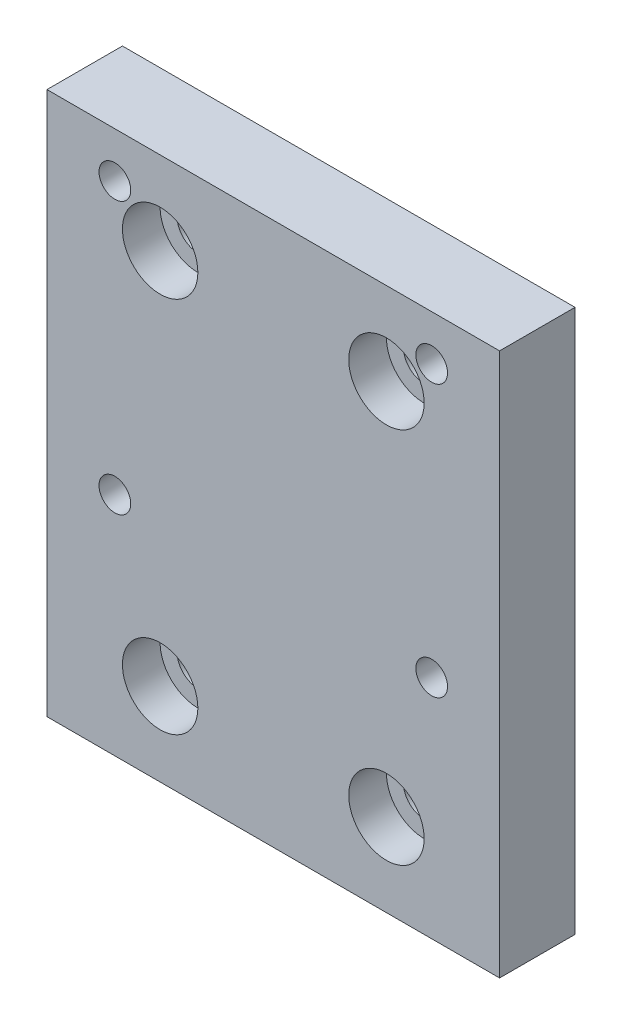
ISO-10303-21;
HEADER;
FILE_DESCRIPTION(('STEP AP214'),'2;1');
FILE_NAME('part.step','',(''),(''),'','','');
FILE_SCHEMA(('AUTOMOTIVE_DESIGN { 1 0 10303 214 1 1 1 1 }'));
ENDSEC;
DATA;
#1=APPLICATION_CONTEXT('core data for automotive mechanical design processes');
#2=APPLICATION_PROTOCOL_DEFINITION('international standard','automotive_design',2000,#1);
#3=PRODUCT_CONTEXT('',#1,'mechanical');
#4=PRODUCT('Part','Part','',(#3));
#5=PRODUCT_RELATED_PRODUCT_CATEGORY('part','',(#4));
#6=PRODUCT_DEFINITION_FORMATION('','',#4);
#7=PRODUCT_DEFINITION_CONTEXT('part definition',#1,'design');
#8=PRODUCT_DEFINITION('design','',#6,#7);
#9=PRODUCT_DEFINITION_SHAPE('','',#8);
#10=(LENGTH_UNIT() NAMED_UNIT(*) SI_UNIT(.MILLI.,.METRE.));
#11=(NAMED_UNIT(*) PLANE_ANGLE_UNIT() SI_UNIT($,.RADIAN.));
#12=(NAMED_UNIT(*) SI_UNIT($,.STERADIAN.) SOLID_ANGLE_UNIT());
#13=UNCERTAINTY_MEASURE_WITH_UNIT(LENGTH_MEASURE(1.E-05),#10,'distance_accuracy_value','');
#14=(GEOMETRIC_REPRESENTATION_CONTEXT(3) GLOBAL_UNCERTAINTY_ASSIGNED_CONTEXT((#13)) GLOBAL_UNIT_ASSIGNED_CONTEXT((#10,
#11,#12)) REPRESENTATION_CONTEXT('',''));
#15=CARTESIAN_POINT('',(0.,0.,0.));
#16=DIRECTION('',(0.,0.,1.));
#17=DIRECTION('',(1.,0.,0.));
#18=AXIS2_PLACEMENT_3D('',#15,#16,#17);
#19=CARTESIAN_POINT('',(15.,-25.,5.));
#20=DIRECTION('',(0.,0.,1.));
#21=DIRECTION('',(1.,0.,0.));
#22=AXIS2_PLACEMENT_3D('',#19,#20,#21);
#23=CYLINDRICAL_SURFACE('',#22,5.);
#24=CARTESIAN_POINT('',(15.,-25.,10.));
#25=DIRECTION('',(0.,0.,1.));
#26=DIRECTION('',(1.,0.,0.));
#27=AXIS2_PLACEMENT_3D('',#24,#25,#26);
#28=CIRCLE('',#27,5.);
#29=CARTESIAN_POINT('',(20.,-25.,10.));
#30=VERTEX_POINT('',#29);
#31=EDGE_CURVE('E139',#30,#30,#28,.F.);
#32=ORIENTED_EDGE('',*,*,#31,.F.);
#33=EDGE_LOOP('',(#32));
#34=FACE_BOUND('',#33,.T.);
#35=CARTESIAN_POINT('',(15.,-25.,5.));
#36=DIRECTION('',(0.,0.,1.));
#37=DIRECTION('',(1.,0.,0.));
#38=AXIS2_PLACEMENT_3D('',#35,#36,#37);
#39=CIRCLE('',#38,5.);
#40=CARTESIAN_POINT('',(20.,-25.,5.));
#41=VERTEX_POINT('',#40);
#42=EDGE_CURVE('E20',#41,#41,#39,.T.);
#43=ORIENTED_EDGE('',*,*,#42,.F.);
#44=EDGE_LOOP('',(#43));
#45=FACE_BOUND('',#44,.T.);
#46=ADVANCED_FACE('F17',(#34,#45),#23,.F.);
#47=CARTESIAN_POINT('',(15.,25.,5.));
#48=DIRECTION('',(0.,0.,1.));
#49=DIRECTION('',(1.,0.,0.));
#50=AXIS2_PLACEMENT_3D('',#47,#48,#49);
#51=CYLINDRICAL_SURFACE('',#50,5.);
#52=CARTESIAN_POINT('',(15.,25.,10.));
#53=DIRECTION('',(0.,0.,1.));
#54=DIRECTION('',(1.,0.,0.));
#55=AXIS2_PLACEMENT_3D('',#52,#53,#54);
#56=CIRCLE('',#55,5.);
#57=CARTESIAN_POINT('',(20.,25.,10.));
#58=VERTEX_POINT('',#57);
#59=EDGE_CURVE('E136',#58,#58,#56,.F.);
#60=ORIENTED_EDGE('',*,*,#59,.F.);
#61=EDGE_LOOP('',(#60));
#62=FACE_BOUND('',#61,.T.);
#63=CARTESIAN_POINT('',(15.,25.,5.));
#64=DIRECTION('',(0.,0.,1.));
#65=DIRECTION('',(1.,0.,0.));
#66=AXIS2_PLACEMENT_3D('',#63,#64,#65);
#67=CIRCLE('',#66,5.);
#68=CARTESIAN_POINT('',(20.,25.,5.));
#69=VERTEX_POINT('',#68);
#70=EDGE_CURVE('E147',#69,#69,#67,.T.);
#71=ORIENTED_EDGE('',*,*,#70,.F.);
#72=EDGE_LOOP('',(#71));
#73=FACE_BOUND('',#72,.T.);
#74=ADVANCED_FACE('F157',(#62,#73),#51,.F.);
#75=CARTESIAN_POINT('',(-15.,-25.,5.));
#76=DIRECTION('',(0.,0.,1.));
#77=DIRECTION('',(1.,0.,0.));
#78=AXIS2_PLACEMENT_3D('',#75,#76,#77);
#79=CYLINDRICAL_SURFACE('',#78,5.);
#80=CARTESIAN_POINT('',(-15.,-25.,10.));
#81=DIRECTION('',(0.,0.,1.));
#82=DIRECTION('',(1.,0.,0.));
#83=AXIS2_PLACEMENT_3D('',#80,#81,#82);
#84=CIRCLE('',#83,5.);
#85=CARTESIAN_POINT('',(-9.99999999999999,-25.,10.));
#86=VERTEX_POINT('',#85);
#87=EDGE_CURVE('E133',#86,#86,#84,.F.);
#88=ORIENTED_EDGE('',*,*,#87,.F.);
#89=EDGE_LOOP('',(#88));
#90=FACE_BOUND('',#89,.T.);
#91=CARTESIAN_POINT('',(-15.,-25.,5.));
#92=DIRECTION('',(0.,0.,1.));
#93=DIRECTION('',(1.,0.,0.));
#94=AXIS2_PLACEMENT_3D('',#91,#92,#93);
#95=CIRCLE('',#94,5.);
#96=CARTESIAN_POINT('',(-9.99999999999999,-25.,5.));
#97=VERTEX_POINT('',#96);
#98=EDGE_CURVE('E145',#97,#97,#95,.T.);
#99=ORIENTED_EDGE('',*,*,#98,.F.);
#100=EDGE_LOOP('',(#99));
#101=FACE_BOUND('',#100,.T.);
#102=ADVANCED_FACE('F163',(#90,#101),#79,.F.);
#103=CARTESIAN_POINT('',(-15.,25.,5.));
#104=DIRECTION('',(0.,0.,1.));
#105=DIRECTION('',(1.,0.,0.));
#106=AXIS2_PLACEMENT_3D('',#103,#104,#105);
#107=CYLINDRICAL_SURFACE('',#106,5.);
#108=CARTESIAN_POINT('',(-15.,25.,10.));
#109=DIRECTION('',(0.,0.,1.));
#110=DIRECTION('',(1.,0.,0.));
#111=AXIS2_PLACEMENT_3D('',#108,#109,#110);
#112=CIRCLE('',#111,5.);
#113=CARTESIAN_POINT('',(-10.,25.,10.));
#114=VERTEX_POINT('',#113);
#115=EDGE_CURVE('E130',#114,#114,#112,.F.);
#116=ORIENTED_EDGE('',*,*,#115,.F.);
#117=EDGE_LOOP('',(#116));
#118=FACE_BOUND('',#117,.T.);
#119=CARTESIAN_POINT('',(-15.,25.,5.));
#120=DIRECTION('',(0.,0.,1.));
#121=DIRECTION('',(1.,0.,0.));
#122=AXIS2_PLACEMENT_3D('',#119,#120,#121);
#123=CIRCLE('',#122,5.);
#124=CARTESIAN_POINT('',(-10.,25.,5.));
#125=VERTEX_POINT('',#124);
#126=EDGE_CURVE('E142',#125,#125,#123,.T.);
#127=ORIENTED_EDGE('',*,*,#126,.F.);
#128=EDGE_LOOP('',(#127));
#129=FACE_BOUND('',#128,.T.);
#130=ADVANCED_FACE('F234',(#118,#129),#107,.F.);
#131=CARTESIAN_POINT('',(15.,-25.,5.));
#132=DIRECTION('',(0.,0.,1.));
#133=DIRECTION('',(1.,0.,0.));
#134=AXIS2_PLACEMENT_3D('',#131,#132,#133);
#135=PLANE('',#134);
#136=CARTESIAN_POINT('',(15.,-25.,5.));
#137=DIRECTION('',(0.,0.,1.));
#138=DIRECTION('',(1.,0.,0.));
#139=AXIS2_PLACEMENT_3D('',#136,#137,#138);
#140=CIRCLE('',#139,2.75);
#141=CARTESIAN_POINT('',(17.75,-25.,5.));
#142=VERTEX_POINT('',#141);
#143=EDGE_CURVE('E115',#142,#142,#140,.F.);
#144=ORIENTED_EDGE('',*,*,#143,.T.);
#145=EDGE_LOOP('',(#144));
#146=FACE_BOUND('',#145,.T.);
#147=ORIENTED_EDGE('',*,*,#42,.T.);
#148=EDGE_LOOP('',(#147));
#149=FACE_BOUND('',#148,.T.);
#150=ADVANCED_FACE('F154',(#146,#149),#135,.T.);
#151=CARTESIAN_POINT('',(15.,25.,5.));
#152=DIRECTION('',(0.,0.,1.));
#153=DIRECTION('',(1.,0.,0.));
#154=AXIS2_PLACEMENT_3D('',#151,#152,#153);
#155=PLANE('',#154);
#156=CARTESIAN_POINT('',(15.,25.,5.));
#157=DIRECTION('',(0.,0.,1.));
#158=DIRECTION('',(1.,0.,0.));
#159=AXIS2_PLACEMENT_3D('',#156,#157,#158);
#160=CIRCLE('',#159,2.75);
#161=CARTESIAN_POINT('',(17.75,25.,5.));
#162=VERTEX_POINT('',#161);
#163=EDGE_CURVE('E112',#162,#162,#160,.F.);
#164=ORIENTED_EDGE('',*,*,#163,.T.);
#165=EDGE_LOOP('',(#164));
#166=FACE_BOUND('',#165,.T.);
#167=ORIENTED_EDGE('',*,*,#70,.T.);
#168=EDGE_LOOP('',(#167));
#169=FACE_BOUND('',#168,.T.);
#170=ADVANCED_FACE('F227',(#166,#169),#155,.T.);
#171=CARTESIAN_POINT('',(-15.,-25.,5.));
#172=DIRECTION('',(0.,0.,1.));
#173=DIRECTION('',(1.,0.,0.));
#174=AXIS2_PLACEMENT_3D('',#171,#172,#173);
#175=PLANE('',#174);
#176=CARTESIAN_POINT('',(-15.,-25.,5.));
#177=DIRECTION('',(0.,0.,1.));
#178=DIRECTION('',(1.,0.,0.));
#179=AXIS2_PLACEMENT_3D('',#176,#177,#178);
#180=CIRCLE('',#179,2.75);
#181=CARTESIAN_POINT('',(-12.25,-25.,5.));
#182=VERTEX_POINT('',#181);
#183=EDGE_CURVE('E109',#182,#182,#180,.F.);
#184=ORIENTED_EDGE('',*,*,#183,.T.);
#185=EDGE_LOOP('',(#184));
#186=FACE_BOUND('',#185,.T.);
#187=ORIENTED_EDGE('',*,*,#98,.T.);
#188=EDGE_LOOP('',(#187));
#189=FACE_BOUND('',#188,.T.);
#190=ADVANCED_FACE('F223',(#186,#189),#175,.T.);
#191=CARTESIAN_POINT('',(-15.,25.,5.));
#192=DIRECTION('',(0.,0.,1.));
#193=DIRECTION('',(1.,0.,0.));
#194=AXIS2_PLACEMENT_3D('',#191,#192,#193);
#195=PLANE('',#194);
#196=CARTESIAN_POINT('',(-15.,25.,5.));
#197=DIRECTION('',(0.,0.,1.));
#198=DIRECTION('',(1.,0.,0.));
#199=AXIS2_PLACEMENT_3D('',#196,#197,#198);
#200=CIRCLE('',#199,2.75);
#201=CARTESIAN_POINT('',(-12.25,25.,5.));
#202=VERTEX_POINT('',#201);
#203=EDGE_CURVE('E67',#202,#202,#200,.F.);
#204=ORIENTED_EDGE('',*,*,#203,.T.);
#205=EDGE_LOOP('',(#204));
#206=FACE_BOUND('',#205,.T.);
#207=ORIENTED_EDGE('',*,*,#126,.T.);
#208=EDGE_LOOP('',(#207));
#209=FACE_BOUND('',#208,.T.);
#210=ADVANCED_FACE('F220',(#206,#209),#195,.T.);
#211=CARTESIAN_POINT('',(0.,0.,10.));
#212=DIRECTION('',(0.,0.,1.));
#213=DIRECTION('',(1.,0.,0.));
#214=AXIS2_PLACEMENT_3D('',#211,#212,#213);
#215=PLANE('',#214);
#216=DIRECTION('',(0.,1.,0.));
#217=VECTOR('',#216,1.);
#218=CARTESIAN_POINT('',(-30.,36.,10.));
#219=LINE('',#218,#217);
#220=CARTESIAN_POINT('',(-30.,36.,10.));
#221=VERTEX_POINT('',#220);
#222=CARTESIAN_POINT('',(-30.,-36.,10.));
#223=VERTEX_POINT('',#222);
#224=EDGE_CURVE('E55',#221,#223,#219,.F.);
#225=ORIENTED_EDGE('',*,*,#224,.T.);
#226=DIRECTION('',(1.,0.,0.));
#227=VECTOR('',#226,1.);
#228=CARTESIAN_POINT('',(-30.,-36.,10.));
#229=LINE('',#228,#227);
#230=CARTESIAN_POINT('',(30.,-36.,10.));
#231=VERTEX_POINT('',#230);
#232=EDGE_CURVE('E460',#223,#231,#229,.T.);
#233=ORIENTED_EDGE('',*,*,#232,.T.);
#234=DIRECTION('',(0.,-1.,0.));
#235=VECTOR('',#234,1.);
#236=CARTESIAN_POINT('',(30.,36.,10.));
#237=LINE('',#236,#235);
#238=CARTESIAN_POINT('',(30.,36.,10.));
#239=VERTEX_POINT('',#238);
#240=EDGE_CURVE('E61',#231,#239,#237,.F.);
#241=ORIENTED_EDGE('',*,*,#240,.T.);
#242=DIRECTION('',(1.,0.,0.));
#243=VECTOR('',#242,1.);
#244=CARTESIAN_POINT('',(-30.,36.,10.));
#245=LINE('',#244,#243);
#246=EDGE_CURVE('E58',#239,#221,#245,.F.);
#247=ORIENTED_EDGE('',*,*,#246,.T.);
#248=EDGE_LOOP('',(#225,#233,#241,#247));
#249=FACE_BOUND('',#248,.T.);
#250=ORIENTED_EDGE('',*,*,#115,.T.);
#251=EDGE_LOOP('',(#250));
#252=FACE_BOUND('',#251,.T.);
#253=ORIENTED_EDGE('',*,*,#87,.T.);
#254=EDGE_LOOP('',(#253));
#255=FACE_BOUND('',#254,.T.);
#256=ORIENTED_EDGE('',*,*,#59,.T.);
#257=EDGE_LOOP('',(#256));
#258=FACE_BOUND('',#257,.T.);
#259=ORIENTED_EDGE('',*,*,#31,.T.);
#260=EDGE_LOOP('',(#259));
#261=FACE_BOUND('',#260,.T.);
#262=CARTESIAN_POINT('',(-21.,-5.99999999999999,10.));
#263=DIRECTION('',(0.,0.,1.));
#264=DIRECTION('',(1.,0.,0.));
#265=AXIS2_PLACEMENT_3D('',#262,#263,#264);
#266=CIRCLE('',#265,2.1);
#267=CARTESIAN_POINT('',(-18.9,-5.99999999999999,10.));
#268=VERTEX_POINT('',#267);
#269=EDGE_CURVE('E118',#268,#268,#266,.F.);
#270=ORIENTED_EDGE('',*,*,#269,.T.);
#271=EDGE_LOOP('',(#270));
#272=FACE_BOUND('',#271,.T.);
#273=CARTESIAN_POINT('',(21.,-5.99999999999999,10.));
#274=DIRECTION('',(0.,0.,1.));
#275=DIRECTION('',(1.,0.,0.));
#276=AXIS2_PLACEMENT_3D('',#273,#274,#275);
#277=CIRCLE('',#276,2.1);
#278=CARTESIAN_POINT('',(23.1,-5.99999999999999,10.));
#279=VERTEX_POINT('',#278);
#280=EDGE_CURVE('E121',#279,#279,#277,.F.);
#281=ORIENTED_EDGE('',*,*,#280,.T.);
#282=EDGE_LOOP('',(#281));
#283=FACE_BOUND('',#282,.T.);
#284=CARTESIAN_POINT('',(21.,30.,10.));
#285=DIRECTION('',(0.,0.,1.));
#286=DIRECTION('',(1.,0.,0.));
#287=AXIS2_PLACEMENT_3D('',#284,#285,#286);
#288=CIRCLE('',#287,2.1);
#289=CARTESIAN_POINT('',(23.1,30.,10.));
#290=VERTEX_POINT('',#289);
#291=EDGE_CURVE('E124',#290,#290,#288,.F.);
#292=ORIENTED_EDGE('',*,*,#291,.T.);
#293=EDGE_LOOP('',(#292));
#294=FACE_BOUND('',#293,.T.);
#295=CARTESIAN_POINT('',(-21.,30.,10.));
#296=DIRECTION('',(0.,0.,1.));
#297=DIRECTION('',(1.,0.,0.));
#298=AXIS2_PLACEMENT_3D('',#295,#296,#297);
#299=CIRCLE('',#298,2.1);
#300=CARTESIAN_POINT('',(-18.9,30.,10.));
#301=VERTEX_POINT('',#300);
#302=EDGE_CURVE('E127',#301,#301,#299,.F.);
#303=ORIENTED_EDGE('',*,*,#302,.T.);
#304=EDGE_LOOP('',(#303));
#305=FACE_BOUND('',#304,.T.);
#306=ADVANCED_FACE('F59',(#249,#252,#255,#258,#261,#272,#283,#294,#305),#215,.T.);
#307=CARTESIAN_POINT('',(-21.,30.,10.));
#308=DIRECTION('',(0.,0.,1.));
#309=DIRECTION('',(1.,0.,0.));
#310=AXIS2_PLACEMENT_3D('',#307,#308,#309);
#311=CYLINDRICAL_SURFACE('',#310,2.1);
#312=CARTESIAN_POINT('',(-21.,30.,0.));
#313=DIRECTION('',(0.,0.,1.));
#314=DIRECTION('',(1.,0.,0.));
#315=AXIS2_PLACEMENT_3D('',#312,#313,#314);
#316=CIRCLE('',#315,2.1);
#317=CARTESIAN_POINT('',(-18.9,30.,0.));
#318=VERTEX_POINT('',#317);
#319=EDGE_CURVE('E103',#318,#318,#316,.F.);
#320=ORIENTED_EDGE('',*,*,#319,.T.);
#321=EDGE_LOOP('',(#320));
#322=FACE_BOUND('',#321,.T.);
#323=ORIENTED_EDGE('',*,*,#302,.F.);
#324=EDGE_LOOP('',(#323));
#325=FACE_BOUND('',#324,.T.);
#326=ADVANCED_FACE('F213',(#322,#325),#311,.F.);
#327=CARTESIAN_POINT('',(21.,30.,10.));
#328=DIRECTION('',(0.,0.,1.));
#329=DIRECTION('',(1.,0.,0.));
#330=AXIS2_PLACEMENT_3D('',#327,#328,#329);
#331=CYLINDRICAL_SURFACE('',#330,2.1);
#332=CARTESIAN_POINT('',(21.,30.,0.));
#333=DIRECTION('',(0.,0.,1.));
#334=DIRECTION('',(1.,0.,0.));
#335=AXIS2_PLACEMENT_3D('',#332,#333,#334);
#336=CIRCLE('',#335,2.1);
#337=CARTESIAN_POINT('',(23.1,30.,0.));
#338=VERTEX_POINT('',#337);
#339=EDGE_CURVE('E100',#338,#338,#336,.F.);
#340=ORIENTED_EDGE('',*,*,#339,.T.);
#341=EDGE_LOOP('',(#340));
#342=FACE_BOUND('',#341,.T.);
#343=ORIENTED_EDGE('',*,*,#291,.F.);
#344=EDGE_LOOP('',(#343));
#345=FACE_BOUND('',#344,.T.);
#346=ADVANCED_FACE('F209',(#342,#345),#331,.F.);
#347=CARTESIAN_POINT('',(21.,-5.99999999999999,10.));
#348=DIRECTION('',(0.,0.,1.));
#349=DIRECTION('',(1.,0.,0.));
#350=AXIS2_PLACEMENT_3D('',#347,#348,#349);
#351=CYLINDRICAL_SURFACE('',#350,2.1);
#352=CARTESIAN_POINT('',(21.,-5.99999999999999,0.));
#353=DIRECTION('',(0.,0.,1.));
#354=DIRECTION('',(1.,0.,0.));
#355=AXIS2_PLACEMENT_3D('',#352,#353,#354);
#356=CIRCLE('',#355,2.1);
#357=CARTESIAN_POINT('',(23.1,-5.99999999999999,0.));
#358=VERTEX_POINT('',#357);
#359=EDGE_CURVE('E97',#358,#358,#356,.F.);
#360=ORIENTED_EDGE('',*,*,#359,.T.);
#361=EDGE_LOOP('',(#360));
#362=FACE_BOUND('',#361,.T.);
#363=ORIENTED_EDGE('',*,*,#280,.F.);
#364=EDGE_LOOP('',(#363));
#365=FACE_BOUND('',#364,.T.);
#366=ADVANCED_FACE('F205',(#362,#365),#351,.F.);
#367=CARTESIAN_POINT('',(-21.,-5.99999999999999,10.));
#368=DIRECTION('',(0.,0.,1.));
#369=DIRECTION('',(1.,0.,0.));
#370=AXIS2_PLACEMENT_3D('',#367,#368,#369);
#371=CYLINDRICAL_SURFACE('',#370,2.1);
#372=CARTESIAN_POINT('',(-21.,-5.99999999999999,0.));
#373=DIRECTION('',(0.,0.,1.));
#374=DIRECTION('',(1.,0.,0.));
#375=AXIS2_PLACEMENT_3D('',#372,#373,#374);
#376=CIRCLE('',#375,2.1);
#377=CARTESIAN_POINT('',(-18.9,-5.99999999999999,0.));
#378=VERTEX_POINT('',#377);
#379=EDGE_CURVE('E94',#378,#378,#376,.F.);
#380=ORIENTED_EDGE('',*,*,#379,.T.);
#381=EDGE_LOOP('',(#380));
#382=FACE_BOUND('',#381,.T.);
#383=ORIENTED_EDGE('',*,*,#269,.F.);
#384=EDGE_LOOP('',(#383));
#385=FACE_BOUND('',#384,.T.);
#386=ADVANCED_FACE('F201',(#382,#385),#371,.F.);
#387=CARTESIAN_POINT('',(15.,-25.,0.));
#388=DIRECTION('',(0.,0.,1.));
#389=DIRECTION('',(1.,0.,0.));
#390=AXIS2_PLACEMENT_3D('',#387,#388,#389);
#391=CYLINDRICAL_SURFACE('',#390,2.75);
#392=CARTESIAN_POINT('',(15.,-25.,0.));
#393=DIRECTION('',(0.,0.,1.));
#394=DIRECTION('',(1.,0.,0.));
#395=AXIS2_PLACEMENT_3D('',#392,#393,#394);
#396=CIRCLE('',#395,2.75);
#397=CARTESIAN_POINT('',(17.75,-25.,0.));
#398=VERTEX_POINT('',#397);
#399=EDGE_CURVE('E91',#398,#398,#396,.F.);
#400=ORIENTED_EDGE('',*,*,#399,.T.);
#401=EDGE_LOOP('',(#400));
#402=FACE_BOUND('',#401,.T.);
#403=ORIENTED_EDGE('',*,*,#143,.F.);
#404=EDGE_LOOP('',(#403));
#405=FACE_BOUND('',#404,.T.);
#406=ADVANCED_FACE('F197',(#402,#405),#391,.F.);
#407=CARTESIAN_POINT('',(15.,25.,0.));
#408=DIRECTION('',(0.,0.,1.));
#409=DIRECTION('',(1.,0.,0.));
#410=AXIS2_PLACEMENT_3D('',#407,#408,#409);
#411=CYLINDRICAL_SURFACE('',#410,2.75);
#412=CARTESIAN_POINT('',(15.,25.,0.));
#413=DIRECTION('',(0.,0.,1.));
#414=DIRECTION('',(1.,0.,0.));
#415=AXIS2_PLACEMENT_3D('',#412,#413,#414);
#416=CIRCLE('',#415,2.75);
#417=CARTESIAN_POINT('',(17.75,25.,0.));
#418=VERTEX_POINT('',#417);
#419=EDGE_CURVE('E88',#418,#418,#416,.F.);
#420=ORIENTED_EDGE('',*,*,#419,.T.);
#421=EDGE_LOOP('',(#420));
#422=FACE_BOUND('',#421,.T.);
#423=ORIENTED_EDGE('',*,*,#163,.F.);
#424=EDGE_LOOP('',(#423));
#425=FACE_BOUND('',#424,.T.);
#426=ADVANCED_FACE('F193',(#422,#425),#411,.F.);
#427=CARTESIAN_POINT('',(-15.,-25.,0.));
#428=DIRECTION('',(0.,0.,1.));
#429=DIRECTION('',(1.,0.,0.));
#430=AXIS2_PLACEMENT_3D('',#427,#428,#429);
#431=CYLINDRICAL_SURFACE('',#430,2.75);
#432=CARTESIAN_POINT('',(-15.,-25.,0.));
#433=DIRECTION('',(0.,0.,1.));
#434=DIRECTION('',(1.,0.,0.));
#435=AXIS2_PLACEMENT_3D('',#432,#433,#434);
#436=CIRCLE('',#435,2.75);
#437=CARTESIAN_POINT('',(-12.25,-25.,0.));
#438=VERTEX_POINT('',#437);
#439=EDGE_CURVE('E85',#438,#438,#436,.F.);
#440=ORIENTED_EDGE('',*,*,#439,.T.);
#441=EDGE_LOOP('',(#440));
#442=FACE_BOUND('',#441,.T.);
#443=ORIENTED_EDGE('',*,*,#183,.F.);
#444=EDGE_LOOP('',(#443));
#445=FACE_BOUND('',#444,.T.);
#446=ADVANCED_FACE('F189',(#442,#445),#431,.F.);
#447=CARTESIAN_POINT('',(-15.,25.,0.));
#448=DIRECTION('',(0.,0.,1.));
#449=DIRECTION('',(1.,0.,0.));
#450=AXIS2_PLACEMENT_3D('',#447,#448,#449);
#451=CYLINDRICAL_SURFACE('',#450,2.75);
#452=CARTESIAN_POINT('',(-15.,25.,0.));
#453=DIRECTION('',(0.,0.,1.));
#454=DIRECTION('',(1.,0.,0.));
#455=AXIS2_PLACEMENT_3D('',#452,#453,#454);
#456=CIRCLE('',#455,2.75);
#457=CARTESIAN_POINT('',(-12.25,25.,0.));
#458=VERTEX_POINT('',#457);
#459=EDGE_CURVE('E82',#458,#458,#456,.F.);
#460=ORIENTED_EDGE('',*,*,#459,.T.);
#461=EDGE_LOOP('',(#460));
#462=FACE_BOUND('',#461,.T.);
#463=ORIENTED_EDGE('',*,*,#203,.F.);
#464=EDGE_LOOP('',(#463));
#465=FACE_BOUND('',#464,.T.);
#466=ADVANCED_FACE('F186',(#462,#465),#451,.F.);
#467=CARTESIAN_POINT('',(-30.,36.,10.));
#468=DIRECTION('',(0.,-1.,0.));
#469=DIRECTION('',(0.,0.,-1.));
#470=AXIS2_PLACEMENT_3D('',#467,#468,#469);
#471=PLANE('',#470);
#472=DIRECTION('',(0.,0.,1.));
#473=VECTOR('',#472,1.);
#474=CARTESIAN_POINT('',(-30.,36.,10.));
#475=LINE('',#474,#473);
#476=CARTESIAN_POINT('',(-30.,36.,0.));
#477=VERTEX_POINT('',#476);
#478=EDGE_CURVE('E66',#477,#221,#475,.T.);
#479=ORIENTED_EDGE('',*,*,#478,.T.);
#480=ORIENTED_EDGE('',*,*,#246,.F.);
#481=DIRECTION('',(0.,0.,1.));
#482=VECTOR('',#481,1.);
#483=CARTESIAN_POINT('',(30.,36.,10.));
#484=LINE('',#483,#482);
#485=CARTESIAN_POINT('',(30.,36.,0.));
#486=VERTEX_POINT('',#485);
#487=EDGE_CURVE('E106',#239,#486,#484,.F.);
#488=ORIENTED_EDGE('',*,*,#487,.T.);
#489=DIRECTION('',(1.,0.,0.));
#490=VECTOR('',#489,1.);
#491=CARTESIAN_POINT('',(0.,36.,0.));
#492=LINE('',#491,#490);
#493=EDGE_CURVE('E78',#486,#477,#492,.F.);
#494=ORIENTED_EDGE('',*,*,#493,.T.);
#495=EDGE_LOOP('',(#479,#480,#488,#494));
#496=FACE_BOUND('',#495,.T.);
#497=ADVANCED_FACE('F77',(#496),#471,.F.);
#498=CARTESIAN_POINT('',(-30.,36.,10.));
#499=DIRECTION('',(1.,0.,0.));
#500=DIRECTION('',(0.,1.,0.));
#501=AXIS2_PLACEMENT_3D('',#498,#499,#500);
#502=PLANE('',#501);
#503=DIRECTION('',(0.,0.,1.));
#504=VECTOR('',#503,1.);
#505=CARTESIAN_POINT('',(-30.,-36.,10.));
#506=LINE('',#505,#504);
#507=CARTESIAN_POINT('',(-30.,-36.,0.));
#508=VERTEX_POINT('',#507);
#509=EDGE_CURVE('E74',#508,#223,#506,.T.);
#510=ORIENTED_EDGE('',*,*,#509,.T.);
#511=ORIENTED_EDGE('',*,*,#224,.F.);
#512=ORIENTED_EDGE('',*,*,#478,.F.);
#513=DIRECTION('',(0.,1.,0.));
#514=VECTOR('',#513,1.);
#515=CARTESIAN_POINT('',(-30.,0.,0.));
#516=LINE('',#515,#514);
#517=EDGE_CURVE('E467',#477,#508,#516,.F.);
#518=ORIENTED_EDGE('',*,*,#517,.T.);
#519=EDGE_LOOP('',(#510,#511,#512,#518));
#520=FACE_BOUND('',#519,.T.);
#521=ADVANCED_FACE('F71',(#520),#502,.F.);
#522=CARTESIAN_POINT('',(-30.,-36.,10.));
#523=DIRECTION('',(0.,1.,0.));
#524=DIRECTION('',(0.,0.,1.));
#525=AXIS2_PLACEMENT_3D('',#522,#523,#524);
#526=PLANE('',#525);
#527=DIRECTION('',(0.,0.,1.));
#528=VECTOR('',#527,1.);
#529=CARTESIAN_POINT('',(30.,-36.,10.));
#530=LINE('',#529,#528);
#531=CARTESIAN_POINT('',(30.,-36.,0.));
#532=VERTEX_POINT('',#531);
#533=EDGE_CURVE('E34',#532,#231,#530,.T.);
#534=ORIENTED_EDGE('',*,*,#533,.T.);
#535=ORIENTED_EDGE('',*,*,#232,.F.);
#536=ORIENTED_EDGE('',*,*,#509,.F.);
#537=DIRECTION('',(1.,0.,0.));
#538=VECTOR('',#537,1.);
#539=CARTESIAN_POINT('',(0.,-36.,0.));
#540=LINE('',#539,#538);
#541=EDGE_CURVE('E26',#508,#532,#540,.T.);
#542=ORIENTED_EDGE('',*,*,#541,.T.);
#543=EDGE_LOOP('',(#534,#535,#536,#542));
#544=FACE_BOUND('',#543,.T.);
#545=ADVANCED_FACE('F174',(#544),#526,.F.);
#546=CARTESIAN_POINT('',(30.,36.,10.));
#547=DIRECTION('',(-1.,0.,0.));
#548=DIRECTION('',(0.,-1.,0.));
#549=AXIS2_PLACEMENT_3D('',#546,#547,#548);
#550=PLANE('',#549);
#551=ORIENTED_EDGE('',*,*,#487,.F.);
#552=ORIENTED_EDGE('',*,*,#240,.F.);
#553=ORIENTED_EDGE('',*,*,#533,.F.);
#554=DIRECTION('',(0.,1.,0.));
#555=VECTOR('',#554,1.);
#556=CARTESIAN_POINT('',(30.,0.,0.));
#557=LINE('',#556,#555);
#558=EDGE_CURVE('E11',#532,#486,#557,.T.);
#559=ORIENTED_EDGE('',*,*,#558,.T.);
#560=EDGE_LOOP('',(#551,#552,#553,#559));
#561=FACE_BOUND('',#560,.T.);
#562=ADVANCED_FACE('F168',(#561),#550,.F.);
#563=CARTESIAN_POINT('',(0.,0.,0.));
#564=DIRECTION('',(0.,0.,1.));
#565=DIRECTION('',(1.,0.,0.));
#566=AXIS2_PLACEMENT_3D('',#563,#564,#565);
#567=PLANE('',#566);
#568=ORIENTED_EDGE('',*,*,#541,.F.);
#569=ORIENTED_EDGE('',*,*,#517,.F.);
#570=ORIENTED_EDGE('',*,*,#493,.F.);
#571=ORIENTED_EDGE('',*,*,#558,.F.);
#572=EDGE_LOOP('',(#568,#569,#570,#571));
#573=FACE_BOUND('',#572,.T.);
#574=ORIENTED_EDGE('',*,*,#459,.F.);
#575=EDGE_LOOP('',(#574));
#576=FACE_BOUND('',#575,.T.);
#577=ORIENTED_EDGE('',*,*,#439,.F.);
#578=EDGE_LOOP('',(#577));
#579=FACE_BOUND('',#578,.T.);
#580=ORIENTED_EDGE('',*,*,#419,.F.);
#581=EDGE_LOOP('',(#580));
#582=FACE_BOUND('',#581,.T.);
#583=ORIENTED_EDGE('',*,*,#399,.F.);
#584=EDGE_LOOP('',(#583));
#585=FACE_BOUND('',#584,.T.);
#586=ORIENTED_EDGE('',*,*,#379,.F.);
#587=EDGE_LOOP('',(#586));
#588=FACE_BOUND('',#587,.T.);
#589=ORIENTED_EDGE('',*,*,#359,.F.);
#590=EDGE_LOOP('',(#589));
#591=FACE_BOUND('',#590,.T.);
#592=ORIENTED_EDGE('',*,*,#339,.F.);
#593=EDGE_LOOP('',(#592));
#594=FACE_BOUND('',#593,.T.);
#595=ORIENTED_EDGE('',*,*,#319,.F.);
#596=EDGE_LOOP('',(#595));
#597=FACE_BOUND('',#596,.T.);
#598=ADVANCED_FACE('F166',(#573,#576,#579,#582,#585,#588,#591,#594,#597),#567,.F.);
#599=CLOSED_SHELL('',(#46,#74,#102,#130,#150,#170,#190,#210,#306,#326,#346,#366,#386,#406,#426,
#446,#466,#497,#521,#545,#562,#598));
#600=MANIFOLD_SOLID_BREP('B1',#599);
#601=ADVANCED_BREP_SHAPE_REPRESENTATION('',(#18,#600),#14);
#602=SHAPE_DEFINITION_REPRESENTATION(#9,#601);
ENDSEC;
END-ISO-10303-21;
